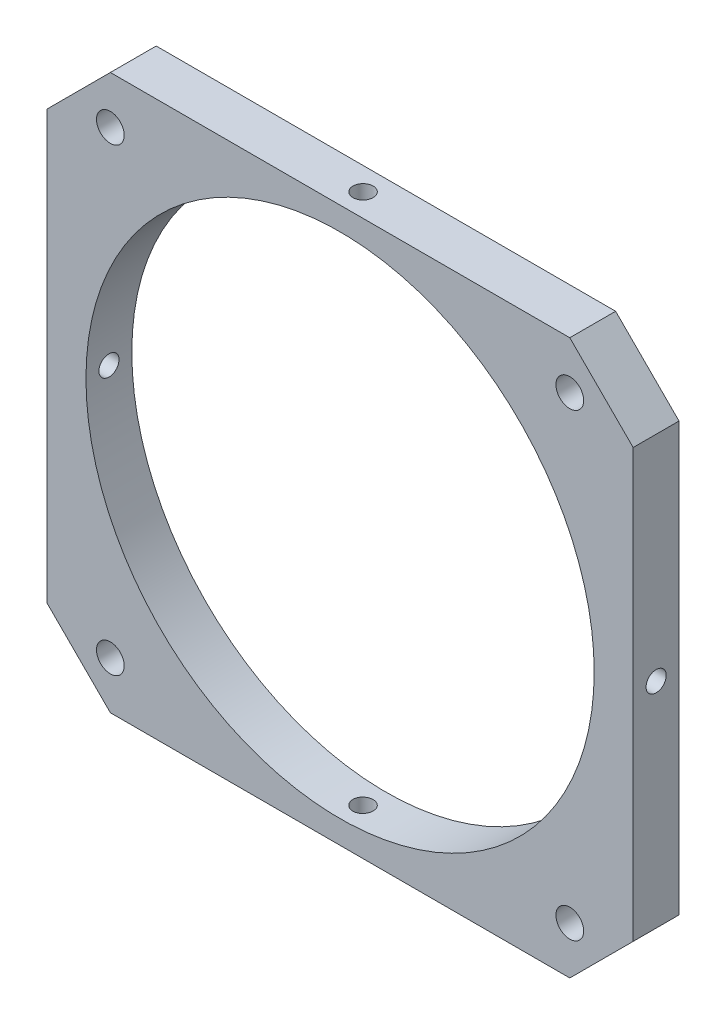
from build123d import *

# Parameters (mm, degrees)
SKETCH1_R                       = 50.927
BOSS_EXTRUDE1_DEPTH             = 19.05
SKETCH4_W                       = 2.0193
SKETCH4_H                       = 58.7375
CIRPATTERN1_COUNT               = 4
F_7_32_0_21875_DIAMETER_HOLE1_D = 5.55625
CUT_EXTRUDE1_DEPTH              = 10.31875
CUT_EXTRUDE2_DEPTH              = 84.06736928
CUT_EXTRUDE2_DEPTH_BACK         = 84.06736928
BOSS_EXTRUDE2_START             = 0.4572
SKETCH10_R                      = 50.927
SKETCH10_R_2                    = 2.778125
BOSS_EXTRUDE2_DEPTH             = 0.4572


with BuildPart() as part:
    # Sketch1 → Boss-Extrude1 (new body)
    with BuildSketch(Plane.XY):
        Polygon((-46.0375, -55.5625), (46.0375, -55.5625), (58.7375, -42.8625), (58.7375, 42.8625), (46.0375, 55.5625), (-46.0375, 55.5625), (-58.7375, 42.8625), (-58.7375, -42.8625), align=None)
        with Locations(Location((0, 0, 0), (0, 0, 180))):
            Circle(SKETCH1_R, mode=Mode.SUBTRACT)
    extrude(amount=BOSS_EXTRUDE1_DEPTH)

    # Sketch4 → 10-32 Tapped Hole1 (revolve, cut)
    with BuildSketch(Plane(origin=(0, 0, 14.44553), x_dir=(0, 0, 1), z_dir=(0, 1, 0))):
        with Locations((1.00965, 29.36875)):
            Rectangle(SKETCH4_W, SKETCH4_H)
    f_10_32_tapped_hole1 = revolve(axis=Axis((-6.35, 0, 14.44553), (1, 0, 0)), mode=Mode.SUBTRACT)

    # CirPattern1: 10-32 Tapped Hole1 ×4 about axis
    cirpattern1_axis = Axis((0, 0, 19.05), (0, 0, -1))
    for i in range(1, CIRPATTERN1_COUNT):
        add(f_10_32_tapped_hole1.rotate(cirpattern1_axis, i * 360 / CIRPATTERN1_COUNT), mode=Mode.SUBTRACT)

    # 7_32 _0.21875_ Diameter Hole1 (through all)
    with Locations(Plane.XY.offset(19.05)):
        with Locations((-46.0375, -46.0375), (-46.0375, 46.0375), (46.0375, 46.0375), (46.0375, -46.0375)):
            Hole(F_7_32_0_21875_DIAMETER_HOLE1_D / 2)

    # Sketch8 → Cut-Extrude1 (cut)
    with BuildSketch(Plane(origin=(0, 0, 0), x_dir=(-1, 0, 0), z_dir=(0, 0, -1))):
        Polygon((17.236859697, 61.9125), (65.0875, 14.061859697), (65.0875, 61.9125), align=None)
        Polygon((65.0875, -61.9125), (65.0875, -14.061859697), (17.236859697, -61.9125), align=None)
        Polygon((-17.236859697, -61.9125), (-65.0875, -61.9125), (-65.0875, -14.061859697), align=None)
        Polygon((-65.0875, 61.9125), (-17.236859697, 61.9125), (-65.0875, 14.061859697), align=None)
    extrude(amount=-CUT_EXTRUDE1_DEPTH, mode=Mode.SUBTRACT)

    # Sketch9 → Cut-Extrude2 (cut, two sides: drawn at the far end of the back side and taken through both)
    with BuildSketch(Plane(origin=(0, 0, 0), x_dir=(0, 0, -1), z_dir=(1, 0, 0)).offset(-CUT_EXTRUDE2_DEPTH_BACK)):
        Polygon((-10.31875, 308.334155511), (-10.31875, 62.000811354), (-10.31875, -62.152774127), (-10.31875, -308.486118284), (482.347938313, -308.486118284), (482.347938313, 308.334155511), align=None)
    extrude(amount=CUT_EXTRUDE2_DEPTH + CUT_EXTRUDE2_DEPTH_BACK, mode=Mode.SUBTRACT)

    # Sketch10 → Boss-Extrude2 (add)
    with BuildSketch(Plane(origin=(0, 0, 10.31875), x_dir=(-1, 0, 0), z_dir=(0, 0, -1)).offset(BOSS_EXTRUDE2_START)):
        Polygon((46.0375, 55.5625), (-46.0375, 55.5625), (-58.7375, 42.8625), (-58.7375, -42.8625), (-46.0375, -55.5625), (46.0375, -55.5625), (58.7375, -42.8625), (58.7375, 42.8625), align=None)
        Circle(SKETCH10_R, mode=Mode.SUBTRACT)
        with Locations(Location((46.0375, 46.0375, 0), (0, 0, 180))):
            Circle(SKETCH10_R_2, mode=Mode.SUBTRACT)
        with Locations(Location((-46.0375, 46.0375, 0), (0, 0, 180))):
            Circle(SKETCH10_R_2, mode=Mode.SUBTRACT)
        with Locations(Location((-46.0375, -46.0375, 0), (0, 0, 180))):
            Circle(SKETCH10_R_2, mode=Mode.SUBTRACT)
        with Locations(Location((46.0375, -46.0375, 0), (0, 0, 180))):
            Circle(SKETCH10_R_2, mode=Mode.SUBTRACT)
    extrude(amount=-BOSS_EXTRUDE2_DEPTH)


solid = part.part
